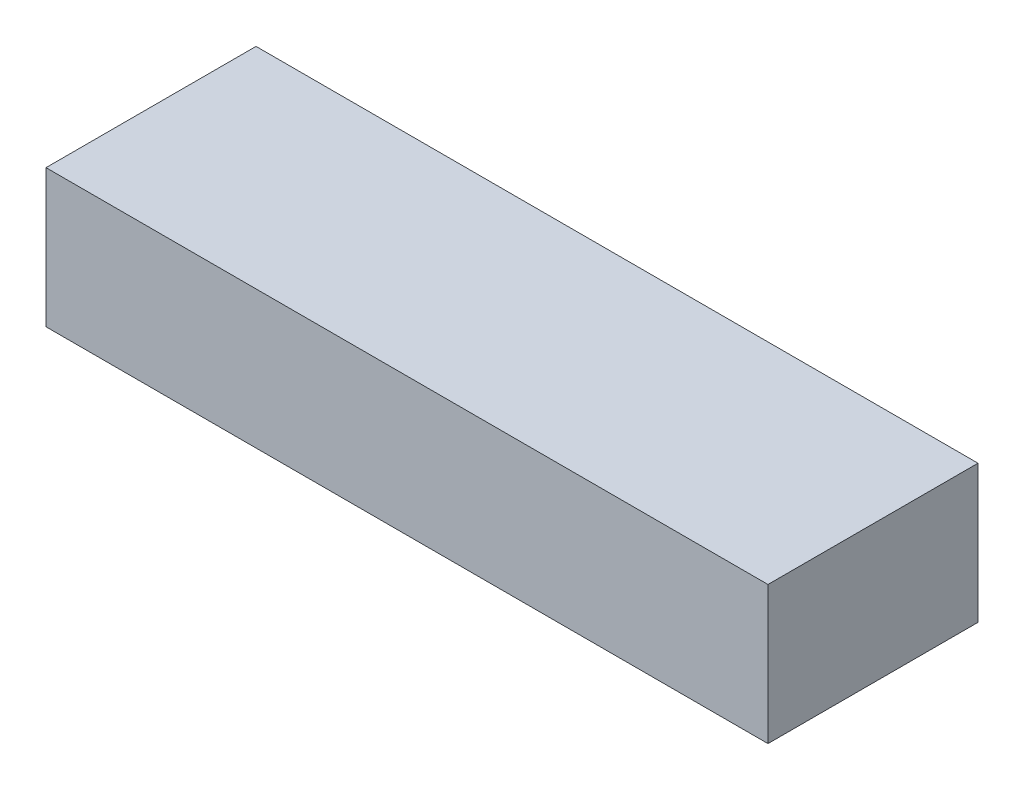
from build123d import *

# Parameters (mm, degrees)
SKETCH_1_W      = 110
SKETCH_1_H      = 32
EXTRUDE_1_DEPTH = 21


with BuildPart() as part:
    # Sketch 1 → Extrude 1 (new body)
    with BuildSketch(Plane(origin=(0, 0, 0), x_dir=(1, 0, 0), z_dir=(0, 1, 0))):
        Rectangle(SKETCH_1_W, SKETCH_1_H)
    extrude(amount=EXTRUDE_1_DEPTH)


solid = part.part
